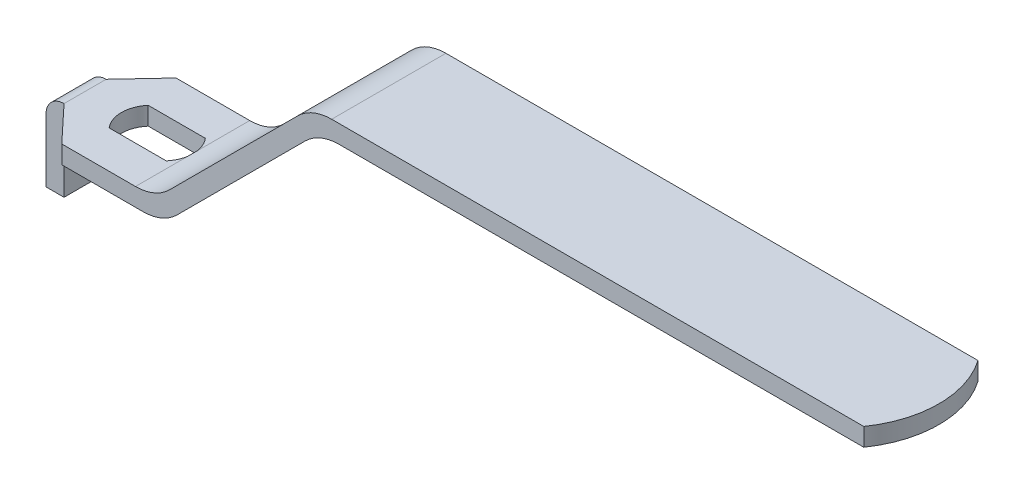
ISO-10303-21;
HEADER;
FILE_DESCRIPTION(('STEP AP214'),'2;1');
FILE_NAME('part.step','',(''),(''),'','','');
FILE_SCHEMA(('AUTOMOTIVE_DESIGN { 1 0 10303 214 1 1 1 1 }'));
ENDSEC;
DATA;
#1=APPLICATION_CONTEXT('core data for automotive mechanical design processes');
#2=APPLICATION_PROTOCOL_DEFINITION('international standard','automotive_design',2000,#1);
#3=PRODUCT_CONTEXT('',#1,'mechanical');
#4=PRODUCT('Part','Part','',(#3));
#5=PRODUCT_RELATED_PRODUCT_CATEGORY('part','',(#4));
#6=PRODUCT_DEFINITION_FORMATION('','',#4);
#7=PRODUCT_DEFINITION_CONTEXT('part definition',#1,'design');
#8=PRODUCT_DEFINITION('design','',#6,#7);
#9=PRODUCT_DEFINITION_SHAPE('','',#8);
#10=(LENGTH_UNIT() NAMED_UNIT(*) SI_UNIT(.MILLI.,.METRE.));
#11=(NAMED_UNIT(*) PLANE_ANGLE_UNIT() SI_UNIT($,.RADIAN.));
#12=(NAMED_UNIT(*) SI_UNIT($,.STERADIAN.) SOLID_ANGLE_UNIT());
#13=UNCERTAINTY_MEASURE_WITH_UNIT(LENGTH_MEASURE(1.E-05),#10,'distance_accuracy_value','');
#14=(GEOMETRIC_REPRESENTATION_CONTEXT(3) GLOBAL_UNCERTAINTY_ASSIGNED_CONTEXT((#13)) GLOBAL_UNIT_ASSIGNED_CONTEXT((#10,
#11,#12)) REPRESENTATION_CONTEXT('',''));
#15=CARTESIAN_POINT('',(0.,0.,0.));
#16=DIRECTION('',(0.,0.,1.));
#17=DIRECTION('',(1.,0.,0.));
#18=AXIS2_PLACEMENT_3D('',#15,#16,#17);
#19=CARTESIAN_POINT('',(-15.,-13.5,9.5));
#20=DIRECTION('',(0.,1.,0.));
#21=DIRECTION('',(0.,0.,1.));
#22=AXIS2_PLACEMENT_3D('',#19,#20,#21);
#23=PLANE('',#22);
#24=DIRECTION('',(1.,0.,0.));
#25=VECTOR('',#24,1.);
#26=CARTESIAN_POINT('',(-23.299911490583,-13.5,-3.5));
#27=LINE('',#26,#25);
#28=CARTESIAN_POINT('',(-15.,-13.5,-3.5));
#29=VERTEX_POINT('',#28);
#30=CARTESIAN_POINT('',(-12.,-13.5,-3.5));
#31=VERTEX_POINT('',#30);
#32=EDGE_CURVE('E219',#29,#31,#27,.T.);
#33=ORIENTED_EDGE('',*,*,#32,.T.);
#34=DIRECTION('',(0.,0.,1.));
#35=VECTOR('',#34,1.);
#36=CARTESIAN_POINT('',(-12.,-13.5,9.5));
#37=LINE('',#36,#35);
#38=CARTESIAN_POINT('',(-12.,-13.5,3.5));
#39=VERTEX_POINT('',#38);
#40=EDGE_CURVE('E220',#31,#39,#37,.T.);
#41=ORIENTED_EDGE('',*,*,#40,.T.);
#42=DIRECTION('',(-1.,0.,0.));
#43=VECTOR('',#42,1.);
#44=CARTESIAN_POINT('',(-23.299911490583,-13.5,3.5));
#45=LINE('',#44,#43);
#46=CARTESIAN_POINT('',(-15.,-13.5,3.5));
#47=VERTEX_POINT('',#46);
#48=EDGE_CURVE('E206',#39,#47,#45,.T.);
#49=ORIENTED_EDGE('',*,*,#48,.T.);
#50=DIRECTION('',(0.,0.,-1.));
#51=VECTOR('',#50,1.);
#52=CARTESIAN_POINT('',(-15.,-13.5,9.5));
#53=LINE('',#52,#51);
#54=EDGE_CURVE('E226',#47,#29,#53,.T.);
#55=ORIENTED_EDGE('',*,*,#54,.T.);
#56=EDGE_LOOP('',(#33,#41,#49,#55));
#57=FACE_BOUND('',#56,.T.);
#58=ADVANCED_FACE('F18',(#57),#23,.F.);
#59=CARTESIAN_POINT('',(-15.,-13.5,9.5));
#60=DIRECTION('',(1.,0.,0.));
#61=DIRECTION('',(0.,0.,-1.));
#62=AXIS2_PLACEMENT_3D('',#59,#60,#61);
#63=PLANE('',#62);
#64=DIRECTION('',(0.,-1.,0.));
#65=VECTOR('',#64,1.);
#66=CARTESIAN_POINT('',(-15.,-19.,-3.5));
#67=LINE('',#66,#65);
#68=CARTESIAN_POINT('',(-15.,-3.,-3.5));
#69=VERTEX_POINT('',#68);
#70=EDGE_CURVE('E173',#69,#29,#67,.T.);
#71=ORIENTED_EDGE('',*,*,#70,.T.);
#72=ORIENTED_EDGE('',*,*,#54,.F.);
#73=DIRECTION('',(0.,1.,0.));
#74=VECTOR('',#73,1.);
#75=CARTESIAN_POINT('',(-15.,-19.,3.5));
#76=LINE('',#75,#74);
#77=CARTESIAN_POINT('',(-15.,-3.,3.5));
#78=VERTEX_POINT('',#77);
#79=EDGE_CURVE('E202',#47,#78,#76,.T.);
#80=ORIENTED_EDGE('',*,*,#79,.T.);
#81=DIRECTION('',(0.,0.,1.));
#82=VECTOR('',#81,1.);
#83=CARTESIAN_POINT('',(-15.,-3.,9.5));
#84=LINE('',#83,#82);
#85=EDGE_CURVE('E177',#69,#78,#84,.T.);
#86=ORIENTED_EDGE('',*,*,#85,.F.);
#87=EDGE_LOOP('',(#71,#72,#80,#86));
#88=FACE_BOUND('',#87,.T.);
#89=ADVANCED_FACE('F447',(#88),#63,.F.);
#90=CARTESIAN_POINT('',(-12.,-13.5,9.5));
#91=DIRECTION('',(-1.,0.,0.));
#92=DIRECTION('',(0.,0.,1.));
#93=AXIS2_PLACEMENT_3D('',#90,#91,#92);
#94=PLANE('',#93);
#95=DIRECTION('',(0.,-1.,0.));
#96=VECTOR('',#95,1.);
#97=CARTESIAN_POINT('',(-12.,-19.,-3.5));
#98=LINE('',#97,#96);
#99=CARTESIAN_POINT('',(-12.,-6.,-3.5));
#100=VERTEX_POINT('',#99);
#101=EDGE_CURVE('E178',#31,#100,#98,.F.);
#102=ORIENTED_EDGE('',*,*,#101,.T.);
#103=DIRECTION('',(0.,0.,1.));
#104=VECTOR('',#103,1.);
#105=CARTESIAN_POINT('',(-12.,-6.,9.5));
#106=LINE('',#105,#104);
#107=CARTESIAN_POINT('',(-12.,-6.,3.50000000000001));
#108=VERTEX_POINT('',#107);
#109=EDGE_CURVE('E205',#100,#108,#106,.T.);
#110=ORIENTED_EDGE('',*,*,#109,.T.);
#111=DIRECTION('',(0.,1.,0.));
#112=VECTOR('',#111,1.);
#113=CARTESIAN_POINT('',(-12.,-19.,3.5));
#114=LINE('',#113,#112);
#115=EDGE_CURVE('E209',#108,#39,#114,.F.);
#116=ORIENTED_EDGE('',*,*,#115,.T.);
#117=ORIENTED_EDGE('',*,*,#40,.F.);
#118=EDGE_LOOP('',(#102,#110,#116,#117));
#119=FACE_BOUND('',#118,.T.);
#120=ADVANCED_FACE('F323',(#119),#94,.F.);
#121=CARTESIAN_POINT('',(-23.299911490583,-19.,-3.5));
#122=DIRECTION('',(0.,0.,1.));
#123=DIRECTION('',(0.,-1.,0.));
#124=AXIS2_PLACEMENT_3D('',#121,#122,#123);
#125=PLANE('',#124);
#126=ORIENTED_EDGE('',*,*,#101,.F.);
#127=ORIENTED_EDGE('',*,*,#32,.F.);
#128=ORIENTED_EDGE('',*,*,#70,.F.);
#129=CARTESIAN_POINT('',(-12.,-3.,-3.5));
#130=DIRECTION('',(0.,0.,1.));
#131=DIRECTION('',(1.,0.,0.));
#132=AXIS2_PLACEMENT_3D('',#129,#130,#131);
#133=CIRCLE('',#132,3.);
#134=CARTESIAN_POINT('',(-12.,0.,-3.5));
#135=VERTEX_POINT('',#134);
#136=EDGE_CURVE('E21',#135,#69,#133,.T.);
#137=ORIENTED_EDGE('',*,*,#136,.F.);
#138=DIRECTION('',(0.,1.,0.));
#139=VECTOR('',#138,1.);
#140=CARTESIAN_POINT('',(-12.,-19.,-3.5));
#141=LINE('',#140,#139);
#142=EDGE_CURVE('E154',#135,#100,#141,.F.);
#143=ORIENTED_EDGE('',*,*,#142,.T.);
#144=EDGE_LOOP('',(#126,#127,#128,#137,#143));
#145=FACE_BOUND('',#144,.T.);
#146=ADVANCED_FACE('F170',(#145),#125,.F.);
#147=CARTESIAN_POINT('',(0.95032896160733,0.,0.));
#148=DIRECTION('',(0.,-1.,0.));
#149=DIRECTION('',(1.,0.,0.));
#150=AXIS2_PLACEMENT_3D('',#147,#148,#149);
#151=PLANE('',#150);
#152=CARTESIAN_POINT('',(0.95032896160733,0.,0.));
#153=DIRECTION('',(0.,-1.,0.));
#154=DIRECTION('',(1.,0.,0.));
#155=AXIS2_PLACEMENT_3D('',#152,#153,#154);
#156=CIRCLE('',#155,5.);
#157=CARTESIAN_POINT('',(5.88244392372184,0.,-0.821122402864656));
#158=VERTEX_POINT('',#157);
#159=CARTESIAN_POINT('',(5.88244392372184,0.,0.821122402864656));
#160=VERTEX_POINT('',#159);
#161=EDGE_CURVE('E305',#158,#160,#156,.T.);
#162=ORIENTED_EDGE('',*,*,#161,.T.);
#163=DIRECTION('',(0.,0.,1.));
#164=VECTOR('',#163,1.);
#165=CARTESIAN_POINT('',(5.88244392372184,0.,9.5));
#166=LINE('',#165,#164);
#167=EDGE_CURVE('E214',#160,#158,#166,.F.);
#168=ORIENTED_EDGE('',*,*,#167,.T.);
#169=EDGE_LOOP('',(#162,#168));
#170=FACE_BOUND('',#169,.T.);
#171=ADVANCED_FACE('F521',(#170),#151,.T.);
#172=CARTESIAN_POINT('',(-12.,-3.,9.5));
#173=DIRECTION('',(0.,0.,1.));
#174=DIRECTION('',(1.,0.,0.));
#175=AXIS2_PLACEMENT_3D('',#172,#173,#174);
#176=CYLINDRICAL_SURFACE('',#175,3.);
#177=ORIENTED_EDGE('',*,*,#85,.T.);
#178=CARTESIAN_POINT('',(-12.,-3.,3.5));
#179=DIRECTION('',(0.,0.,1.));
#180=DIRECTION('',(1.,0.,0.));
#181=AXIS2_PLACEMENT_3D('',#178,#179,#180);
#182=CIRCLE('',#181,3.);
#183=CARTESIAN_POINT('',(-12.,0.,3.50000000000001));
#184=VERTEX_POINT('',#183);
#185=EDGE_CURVE('E191',#78,#184,#182,.F.);
#186=ORIENTED_EDGE('',*,*,#185,.T.);
#187=DIRECTION('',(0.,0.,1.));
#188=VECTOR('',#187,1.);
#189=CARTESIAN_POINT('',(-12.,0.,9.5));
#190=LINE('',#189,#188);
#191=EDGE_CURVE('E183',#184,#135,#190,.F.);
#192=ORIENTED_EDGE('',*,*,#191,.T.);
#193=ORIENTED_EDGE('',*,*,#136,.T.);
#194=EDGE_LOOP('',(#177,#186,#192,#193));
#195=FACE_BOUND('',#194,.T.);
#196=ADVANCED_FACE('F189',(#195),#176,.T.);
#197=CARTESIAN_POINT('',(-23.299911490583,-19.,3.5));
#198=DIRECTION('',(0.,0.,-1.));
#199=DIRECTION('',(-1.,0.,0.));
#200=AXIS2_PLACEMENT_3D('',#197,#198,#199);
#201=PLANE('',#200);
#202=ORIENTED_EDGE('',*,*,#48,.F.);
#203=ORIENTED_EDGE('',*,*,#115,.F.);
#204=DIRECTION('',(0.,1.,0.));
#205=VECTOR('',#204,1.);
#206=CARTESIAN_POINT('',(-12.,-19.,3.50000000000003));
#207=LINE('',#206,#205);
#208=EDGE_CURVE('E292',#108,#184,#207,.T.);
#209=ORIENTED_EDGE('',*,*,#208,.T.);
#210=ORIENTED_EDGE('',*,*,#185,.F.);
#211=ORIENTED_EDGE('',*,*,#79,.F.);
#212=EDGE_LOOP('',(#202,#203,#209,#210,#211));
#213=FACE_BOUND('',#212,.T.);
#214=ADVANCED_FACE('F450',(#213),#201,.F.);
#215=CARTESIAN_POINT('',(-9.,-6.,9.5));
#216=DIRECTION('',(0.,0.,1.));
#217=DIRECTION('',(1.,0.,0.));
#218=AXIS2_PLACEMENT_3D('',#215,#216,#217);
#219=CYLINDRICAL_SURFACE('',#218,3.);
#220=CARTESIAN_POINT('',(-9.,-6.,-6.70000000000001));
#221=DIRECTION('',(0.729537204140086,0.,0.683941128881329));
#222=DIRECTION('',(-0.683941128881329,0.,0.729537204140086));
#223=AXIS2_PLACEMENT_3D('',#220,#221,#222);
#224=ELLIPSE('',#223,4.38634243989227,3.);
#225=CARTESIAN_POINT('',(-9.,-3.,-6.70000000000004));
#226=VERTEX_POINT('',#225);
#227=EDGE_CURVE('E162',#100,#226,#224,.F.);
#228=ORIENTED_EDGE('',*,*,#227,.T.);
#229=DIRECTION('',(0.,0.,1.));
#230=VECTOR('',#229,1.);
#231=CARTESIAN_POINT('',(-9.,-3.,9.5));
#232=LINE('',#231,#230);
#233=CARTESIAN_POINT('',(-9.,-3.,6.7));
#234=VERTEX_POINT('',#233);
#235=EDGE_CURVE('E200',#226,#234,#232,.T.);
#236=ORIENTED_EDGE('',*,*,#235,.T.);
#237=CARTESIAN_POINT('',(-9.,-6.,6.7));
#238=DIRECTION('',(0.729537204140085,0.,-0.68394112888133));
#239=DIRECTION('',(0.68394112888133,0.,0.729537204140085));
#240=AXIS2_PLACEMENT_3D('',#237,#238,#239);
#241=ELLIPSE('',#240,4.38634243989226,3.);
#242=EDGE_CURVE('E187',#234,#108,#241,.F.);
#243=ORIENTED_EDGE('',*,*,#242,.T.);
#244=ORIENTED_EDGE('',*,*,#109,.F.);
#245=EDGE_LOOP('',(#228,#236,#243,#244));
#246=FACE_BOUND('',#245,.T.);
#247=ADVANCED_FACE('F336',(#246),#219,.F.);
#248=CARTESIAN_POINT('',(-0.950328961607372,-13.501,0.));
#249=DIRECTION('',(0.,-1.,0.));
#250=DIRECTION('',(1.,0.,0.));
#251=AXIS2_PLACEMENT_3D('',#248,#249,#250);
#252=CYLINDRICAL_SURFACE('',#251,5.);
#253=DIRECTION('',(0.,1.,0.));
#254=VECTOR('',#253,1.);
#255=CARTESIAN_POINT('',(-4.75,-13.501,-3.25));
#256=LINE('',#255,#254);
#257=CARTESIAN_POINT('',(-4.75,-3.00000000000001,-3.25));
#258=VERTEX_POINT('',#257);
#259=CARTESIAN_POINT('',(-4.75,0.,-3.25));
#260=VERTEX_POINT('',#259);
#261=EDGE_CURVE('E312',#258,#260,#256,.T.);
#262=ORIENTED_EDGE('',*,*,#261,.T.);
#263=CARTESIAN_POINT('',(-0.95032896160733,0.,0.));
#264=DIRECTION('',(0.,-1.,0.));
#265=DIRECTION('',(1.,0.,0.));
#266=AXIS2_PLACEMENT_3D('',#263,#264,#265);
#267=CIRCLE('',#266,5.);
#268=CARTESIAN_POINT('',(-4.75,0.,3.25));
#269=VERTEX_POINT('',#268);
#270=EDGE_CURVE('E296',#260,#269,#267,.F.);
#271=ORIENTED_EDGE('',*,*,#270,.T.);
#272=DIRECTION('',(0.,1.,0.));
#273=VECTOR('',#272,1.);
#274=CARTESIAN_POINT('',(-4.75,-13.501,3.25));
#275=LINE('',#274,#273);
#276=CARTESIAN_POINT('',(-4.75,-3.00000000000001,3.25));
#277=VERTEX_POINT('',#276);
#278=EDGE_CURVE('E304',#269,#277,#275,.F.);
#279=ORIENTED_EDGE('',*,*,#278,.T.);
#280=CARTESIAN_POINT('',(-0.950328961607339,-3.00000000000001,0.));
#281=DIRECTION('',(0.,-1.,0.));
#282=DIRECTION('',(1.,0.,0.));
#283=AXIS2_PLACEMENT_3D('',#280,#281,#282);
#284=CIRCLE('',#283,5.);
#285=EDGE_CURVE('E287',#277,#258,#284,.T.);
#286=ORIENTED_EDGE('',*,*,#285,.T.);
#287=EDGE_LOOP('',(#262,#271,#279,#286));
#288=FACE_BOUND('',#287,.T.);
#289=ADVANCED_FACE('F511',(#288),#252,.F.);
#290=CARTESIAN_POINT('',(-4.75,-13.501,-3.25));
#291=DIRECTION('',(0.,0.,-1.));
#292=DIRECTION('',(-1.,0.,0.));
#293=AXIS2_PLACEMENT_3D('',#290,#291,#292);
#294=PLANE('',#293);
#295=DIRECTION('',(0.,-1.,0.));
#296=VECTOR('',#295,1.);
#297=CARTESIAN_POINT('',(4.74999999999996,-13.501,-3.25));
#298=LINE('',#297,#296);
#299=CARTESIAN_POINT('',(4.74999999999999,-2.99999999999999,-3.25));
#300=VERTEX_POINT('',#299);
#301=CARTESIAN_POINT('',(4.75,0.,-3.25));
#302=VERTEX_POINT('',#301);
#303=EDGE_CURVE('E308',#300,#302,#298,.F.);
#304=ORIENTED_EDGE('',*,*,#303,.T.);
#305=DIRECTION('',(1.,0.,0.));
#306=VECTOR('',#305,1.);
#307=CARTESIAN_POINT('',(-12.,0.,-3.25));
#308=LINE('',#307,#306);
#309=EDGE_CURVE('E299',#302,#260,#308,.F.);
#310=ORIENTED_EDGE('',*,*,#309,.T.);
#311=ORIENTED_EDGE('',*,*,#261,.F.);
#312=DIRECTION('',(1.,0.,0.));
#313=VECTOR('',#312,1.);
#314=CARTESIAN_POINT('',(-9.,-3.,-3.25));
#315=LINE('',#314,#313);
#316=EDGE_CURVE('E286',#258,#300,#315,.T.);
#317=ORIENTED_EDGE('',*,*,#316,.T.);
#318=EDGE_LOOP('',(#304,#310,#311,#317));
#319=FACE_BOUND('',#318,.T.);
#320=ADVANCED_FACE('F507',(#319),#294,.F.);
#321=CARTESIAN_POINT('',(0.950328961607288,-13.501,0.));
#322=DIRECTION('',(0.,-1.,0.));
#323=DIRECTION('',(1.,0.,0.));
#324=AXIS2_PLACEMENT_3D('',#321,#322,#323);
#325=CYLINDRICAL_SURFACE('',#324,5.);
#326=DIRECTION('',(0.,1.,0.));
#327=VECTOR('',#326,1.);
#328=CARTESIAN_POINT('',(4.75,-13.501,3.25));
#329=LINE('',#328,#327);
#330=CARTESIAN_POINT('',(4.74999999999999,-2.99999999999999,3.25));
#331=VERTEX_POINT('',#330);
#332=CARTESIAN_POINT('',(4.75,0.,3.25));
#333=VERTEX_POINT('',#332);
#334=EDGE_CURVE('E307',#331,#333,#329,.T.);
#335=ORIENTED_EDGE('',*,*,#334,.T.);
#336=CARTESIAN_POINT('',(0.95032896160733,0.,0.));
#337=DIRECTION('',(0.,-1.,0.));
#338=DIRECTION('',(1.,0.,0.));
#339=AXIS2_PLACEMENT_3D('',#336,#337,#338);
#340=CIRCLE('',#339,5.);
#341=EDGE_CURVE('E196',#333,#160,#340,.F.);
#342=ORIENTED_EDGE('',*,*,#341,.T.);
#343=ORIENTED_EDGE('',*,*,#161,.F.);
#344=CARTESIAN_POINT('',(0.95032896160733,0.,0.));
#345=DIRECTION('',(0.,-1.,0.));
#346=DIRECTION('',(1.,0.,0.));
#347=AXIS2_PLACEMENT_3D('',#344,#345,#346);
#348=CIRCLE('',#347,5.);
#349=EDGE_CURVE('E300',#158,#302,#348,.F.);
#350=ORIENTED_EDGE('',*,*,#349,.T.);
#351=ORIENTED_EDGE('',*,*,#303,.F.);
#352=CARTESIAN_POINT('',(0.950328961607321,-2.99999999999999,0.));
#353=DIRECTION('',(0.,-1.,0.));
#354=DIRECTION('',(1.,0.,0.));
#355=AXIS2_PLACEMENT_3D('',#352,#353,#354);
#356=CIRCLE('',#355,5.);
#357=EDGE_CURVE('E282',#300,#331,#356,.T.);
#358=ORIENTED_EDGE('',*,*,#357,.T.);
#359=EDGE_LOOP('',(#335,#342,#343,#350,#351,#358));
#360=FACE_BOUND('',#359,.T.);
#361=ADVANCED_FACE('F503',(#360),#325,.F.);
#362=CARTESIAN_POINT('',(-4.75,-13.501,3.25));
#363=DIRECTION('',(0.,0.,1.));
#364=DIRECTION('',(1.,0.,0.));
#365=AXIS2_PLACEMENT_3D('',#362,#363,#364);
#366=PLANE('',#365);
#367=ORIENTED_EDGE('',*,*,#278,.F.);
#368=DIRECTION('',(1.,0.,0.));
#369=VECTOR('',#368,1.);
#370=CARTESIAN_POINT('',(-12.,0.,3.25));
#371=LINE('',#370,#369);
#372=EDGE_CURVE('E295',#269,#333,#371,.T.);
#373=ORIENTED_EDGE('',*,*,#372,.T.);
#374=ORIENTED_EDGE('',*,*,#334,.F.);
#375=DIRECTION('',(1.,0.,0.));
#376=VECTOR('',#375,1.);
#377=CARTESIAN_POINT('',(-9.,-3.,3.25));
#378=LINE('',#377,#376);
#379=EDGE_CURVE('E285',#331,#277,#378,.F.);
#380=ORIENTED_EDGE('',*,*,#379,.T.);
#381=EDGE_LOOP('',(#367,#373,#374,#380));
#382=FACE_BOUND('',#381,.T.);
#383=ADVANCED_FACE('F500',(#382),#366,.F.);
#384=CARTESIAN_POINT('',(-12.,-19.,-3.5));
#385=DIRECTION('',(0.729537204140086,0.,0.683941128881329));
#386=DIRECTION('',(0.683941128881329,0.,-0.729537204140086));
#387=AXIS2_PLACEMENT_3D('',#384,#385,#386);
#388=PLANE('',#387);
#389=DIRECTION('',(0.683941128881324,0.,-0.729537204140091));
#390=VECTOR('',#389,1.);
#391=CARTESIAN_POINT('',(-12.,0.,-3.5));
#392=LINE('',#391,#390);
#393=CARTESIAN_POINT('',(-6.37500000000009,0.,-9.5));
#394=VERTEX_POINT('',#393);
#395=EDGE_CURVE('E159',#135,#394,#392,.T.);
#396=ORIENTED_EDGE('',*,*,#395,.T.);
#397=DIRECTION('',(0.,1.,0.));
#398=VECTOR('',#397,1.);
#399=CARTESIAN_POINT('',(-6.37500000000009,-3.,-9.5));
#400=LINE('',#399,#398);
#401=CARTESIAN_POINT('',(-6.37500000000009,-3.,-9.5));
#402=VERTEX_POINT('',#401);
#403=EDGE_CURVE('E349',#394,#402,#400,.F.);
#404=ORIENTED_EDGE('',*,*,#403,.T.);
#405=DIRECTION('',(-0.683941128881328,0.,0.729537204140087));
#406=VECTOR('',#405,1.);
#407=CARTESIAN_POINT('',(-6.37500000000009,-3.,-9.5));
#408=LINE('',#407,#406);
#409=EDGE_CURVE('E340',#402,#226,#408,.T.);
#410=ORIENTED_EDGE('',*,*,#409,.T.);
#411=ORIENTED_EDGE('',*,*,#227,.F.);
#412=ORIENTED_EDGE('',*,*,#142,.F.);
#413=EDGE_LOOP('',(#396,#404,#410,#411,#412));
#414=FACE_BOUND('',#413,.T.);
#415=ADVANCED_FACE('F156',(#414),#388,.F.);
#416=CARTESIAN_POINT('',(11.5392981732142,2.34314575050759,9.5));
#417=DIRECTION('',(0.707106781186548,-0.707106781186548,0.));
#418=DIRECTION('',(0.707106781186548,0.707106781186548,0.));
#419=AXIS2_PLACEMENT_3D('',#416,#417,#418);
#420=PLANE('',#419);
#421=DIRECTION('',(0.,0.,1.));
#422=VECTOR('',#421,1.);
#423=CARTESIAN_POINT('',(11.5392981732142,2.34314575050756,9.5));
#424=LINE('',#423,#422);
#425=CARTESIAN_POINT('',(11.5392981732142,2.3431457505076,-9.5));
#426=VERTEX_POINT('',#425);
#427=CARTESIAN_POINT('',(11.5392981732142,2.3431457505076,9.5));
#428=VERTEX_POINT('',#427);
#429=EDGE_CURVE('E166',#426,#428,#424,.T.);
#430=ORIENTED_EDGE('',*,*,#429,.T.);
#431=DIRECTION('',(-0.707106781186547,-0.707106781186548,0.));
#432=VECTOR('',#431,1.);
#433=CARTESIAN_POINT('',(32.8530066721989,23.6568542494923,9.5));
#434=LINE('',#433,#432);
#435=CARTESIAN_POINT('',(32.8530066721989,23.6568542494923,9.5));
#436=VERTEX_POINT('',#435);
#437=EDGE_CURVE('E257',#436,#428,#434,.T.);
#438=ORIENTED_EDGE('',*,*,#437,.F.);
#439=DIRECTION('',(0.,0.,1.));
#440=VECTOR('',#439,1.);
#441=CARTESIAN_POINT('',(32.8530066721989,23.6568542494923,9.5));
#442=LINE('',#441,#440);
#443=CARTESIAN_POINT('',(32.8530066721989,23.6568542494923,-9.5));
#444=VERTEX_POINT('',#443);
#445=EDGE_CURVE('E281',#444,#436,#442,.T.);
#446=ORIENTED_EDGE('',*,*,#445,.F.);
#447=DIRECTION('',(-0.707106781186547,-0.707106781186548,0.));
#448=VECTOR('',#447,1.);
#449=CARTESIAN_POINT('',(32.8530066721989,23.6568542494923,-9.5));
#450=LINE('',#449,#448);
#451=EDGE_CURVE('E277',#444,#426,#450,.T.);
#452=ORIENTED_EDGE('',*,*,#451,.T.);
#453=EDGE_LOOP('',(#430,#438,#446,#452));
#454=FACE_BOUND('',#453,.T.);
#455=ADVANCED_FACE('F396',(#454),#420,.F.);
#456=CARTESIAN_POINT('',(5.88244392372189,8.,9.5));
#457=DIRECTION('',(0.,0.,1.));
#458=DIRECTION('',(1.,0.,0.));
#459=AXIS2_PLACEMENT_3D('',#456,#457,#458);
#460=CYLINDRICAL_SURFACE('',#459,8.);
#461=DIRECTION('',(0.,0.,1.));
#462=VECTOR('',#461,1.);
#463=CARTESIAN_POINT('',(5.88244392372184,0.,9.5));
#464=LINE('',#463,#462);
#465=CARTESIAN_POINT('',(5.88244392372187,0.,-9.5));
#466=VERTEX_POINT('',#465);
#467=EDGE_CURVE('E217',#466,#158,#464,.T.);
#468=ORIENTED_EDGE('',*,*,#467,.T.);
#469=ORIENTED_EDGE('',*,*,#167,.F.);
#470=DIRECTION('',(0.,0.,1.));
#471=VECTOR('',#470,1.);
#472=CARTESIAN_POINT('',(5.88244392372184,0.,9.5));
#473=LINE('',#472,#471);
#474=CARTESIAN_POINT('',(5.88244392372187,0.,9.5));
#475=VERTEX_POINT('',#474);
#476=EDGE_CURVE('E193',#160,#475,#473,.T.);
#477=ORIENTED_EDGE('',*,*,#476,.T.);
#478=CARTESIAN_POINT('',(5.88244392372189,8.,9.5));
#479=DIRECTION('',(0.,0.,1.));
#480=DIRECTION('',(1.,0.,0.));
#481=AXIS2_PLACEMENT_3D('',#478,#479,#480);
#482=CIRCLE('',#481,8.);
#483=EDGE_CURVE('E254',#428,#475,#482,.F.);
#484=ORIENTED_EDGE('',*,*,#483,.F.);
#485=ORIENTED_EDGE('',*,*,#429,.F.);
#486=CARTESIAN_POINT('',(5.88244392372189,8.,-9.5));
#487=DIRECTION('',(0.,0.,1.));
#488=DIRECTION('',(1.,0.,0.));
#489=AXIS2_PLACEMENT_3D('',#486,#487,#488);
#490=CIRCLE('',#489,8.);
#491=EDGE_CURVE('E274',#426,#466,#490,.F.);
#492=ORIENTED_EDGE('',*,*,#491,.T.);
#493=EDGE_LOOP('',(#468,#469,#477,#484,#485,#492));
#494=FACE_BOUND('',#493,.T.);
#495=ADVANCED_FACE('F400',(#494),#460,.F.);
#496=CARTESIAN_POINT('',(-12.,0.,9.5));
#497=DIRECTION('',(0.,-1.,0.));
#498=DIRECTION('',(1.,0.,0.));
#499=AXIS2_PLACEMENT_3D('',#496,#497,#498);
#500=PLANE('',#499);
#501=ORIENTED_EDGE('',*,*,#395,.F.);
#502=ORIENTED_EDGE('',*,*,#191,.F.);
#503=DIRECTION('',(-0.68394112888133,0.,-0.729537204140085));
#504=VECTOR('',#503,1.);
#505=CARTESIAN_POINT('',(-12.,0.,3.5));
#506=LINE('',#505,#504);
#507=CARTESIAN_POINT('',(-6.375,0.,9.5));
#508=VERTEX_POINT('',#507);
#509=EDGE_CURVE('E332',#184,#508,#506,.F.);
#510=ORIENTED_EDGE('',*,*,#509,.T.);
#511=DIRECTION('',(1.,0.,0.));
#512=VECTOR('',#511,1.);
#513=CARTESIAN_POINT('',(-12.,0.,9.5));
#514=LINE('',#513,#512);
#515=EDGE_CURVE('E256',#475,#508,#514,.F.);
#516=ORIENTED_EDGE('',*,*,#515,.F.);
#517=ORIENTED_EDGE('',*,*,#476,.F.);
#518=ORIENTED_EDGE('',*,*,#341,.F.);
#519=ORIENTED_EDGE('',*,*,#372,.F.);
#520=ORIENTED_EDGE('',*,*,#270,.F.);
#521=ORIENTED_EDGE('',*,*,#309,.F.);
#522=ORIENTED_EDGE('',*,*,#349,.F.);
#523=ORIENTED_EDGE('',*,*,#467,.F.);
#524=DIRECTION('',(1.,0.,0.));
#525=VECTOR('',#524,1.);
#526=CARTESIAN_POINT('',(-12.,0.,-9.5));
#527=LINE('',#526,#525);
#528=EDGE_CURVE('E186',#466,#394,#527,.F.);
#529=ORIENTED_EDGE('',*,*,#528,.T.);
#530=EDGE_LOOP('',(#501,#502,#510,#516,#517,#518,#519,#520,#521,#522,#523,#529));
#531=FACE_BOUND('',#530,.T.);
#532=ADVANCED_FACE('F181',(#531),#500,.F.);
#533=CARTESIAN_POINT('',(-12.,-19.,3.5));
#534=DIRECTION('',(0.729537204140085,0.,-0.68394112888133));
#535=DIRECTION('',(-0.68394112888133,0.,-0.729537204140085));
#536=AXIS2_PLACEMENT_3D('',#533,#534,#535);
#537=PLANE('',#536);
#538=DIRECTION('',(0.,1.,0.));
#539=VECTOR('',#538,1.);
#540=CARTESIAN_POINT('',(-6.375,-3.,9.5));
#541=LINE('',#540,#539);
#542=CARTESIAN_POINT('',(-6.37500000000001,-3.,9.50000000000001));
#543=VERTEX_POINT('',#542);
#544=EDGE_CURVE('E380',#508,#543,#541,.F.);
#545=ORIENTED_EDGE('',*,*,#544,.F.);
#546=ORIENTED_EDGE('',*,*,#509,.F.);
#547=ORIENTED_EDGE('',*,*,#208,.F.);
#548=ORIENTED_EDGE('',*,*,#242,.F.);
#549=DIRECTION('',(0.68394112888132,0.,0.729537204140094));
#550=VECTOR('',#549,1.);
#551=CARTESIAN_POINT('',(-9.,-3.,6.7));
#552=LINE('',#551,#550);
#553=EDGE_CURVE('E341',#234,#543,#552,.T.);
#554=ORIENTED_EDGE('',*,*,#553,.T.);
#555=EDGE_LOOP('',(#545,#546,#547,#548,#554));
#556=FACE_BOUND('',#555,.T.);
#557=ADVANCED_FACE('F329',(#556),#537,.F.);
#558=CARTESIAN_POINT('',(-9.,-3.,9.5));
#559=DIRECTION('',(0.,1.,0.));
#560=DIRECTION('',(0.,0.,1.));
#561=AXIS2_PLACEMENT_3D('',#558,#559,#560);
#562=PLANE('',#561);
#563=ORIENTED_EDGE('',*,*,#357,.F.);
#564=ORIENTED_EDGE('',*,*,#316,.F.);
#565=ORIENTED_EDGE('',*,*,#285,.F.);
#566=ORIENTED_EDGE('',*,*,#379,.F.);
#567=EDGE_LOOP('',(#563,#564,#565,#566));
#568=FACE_BOUND('',#567,.T.);
#569=ORIENTED_EDGE('',*,*,#409,.F.);
#570=DIRECTION('',(1.,0.,0.));
#571=VECTOR('',#570,1.);
#572=CARTESIAN_POINT('',(-12.,-3.,-9.5));
#573=LINE('',#572,#571);
#574=CARTESIAN_POINT('',(7.1250846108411,-3.,-9.5));
#575=VERTEX_POINT('',#574);
#576=EDGE_CURVE('E273',#402,#575,#573,.T.);
#577=ORIENTED_EDGE('',*,*,#576,.T.);
#578=DIRECTION('',(0.,0.,1.));
#579=VECTOR('',#578,1.);
#580=CARTESIAN_POINT('',(7.1250846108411,-3.,9.5));
#581=LINE('',#580,#579);
#582=CARTESIAN_POINT('',(7.1250846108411,-3.,9.5));
#583=VERTEX_POINT('',#582);
#584=EDGE_CURVE('E373',#583,#575,#581,.F.);
#585=ORIENTED_EDGE('',*,*,#584,.F.);
#586=DIRECTION('',(1.,0.,0.));
#587=VECTOR('',#586,1.);
#588=CARTESIAN_POINT('',(-12.,-3.,9.5));
#589=LINE('',#588,#587);
#590=EDGE_CURVE('E253',#543,#583,#589,.T.);
#591=ORIENTED_EDGE('',*,*,#590,.F.);
#592=ORIENTED_EDGE('',*,*,#553,.F.);
#593=ORIENTED_EDGE('',*,*,#235,.F.);
#594=EDGE_LOOP('',(#569,#577,#585,#591,#592,#593));
#595=FACE_BOUND('',#594,.T.);
#596=ADVANCED_FACE('F434',(#568,#595),#562,.F.);
#597=CARTESIAN_POINT('',(7.1250846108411,5.,9.5));
#598=DIRECTION('',(0.,0.,1.));
#599=DIRECTION('',(1.,0.,0.));
#600=AXIS2_PLACEMENT_3D('',#597,#598,#599);
#601=CYLINDRICAL_SURFACE('',#600,8.);
#602=CARTESIAN_POINT('',(7.1250846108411,5.,9.5));
#603=DIRECTION('',(0.,0.,1.));
#604=DIRECTION('',(1.,0.,0.));
#605=AXIS2_PLACEMENT_3D('',#602,#603,#604);
#606=CIRCLE('',#605,8.);
#607=CARTESIAN_POINT('',(12.7819388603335,-0.656854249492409,9.5));
#608=VERTEX_POINT('',#607);
#609=EDGE_CURVE('E251',#583,#608,#606,.T.);
#610=ORIENTED_EDGE('',*,*,#609,.F.);
#611=ORIENTED_EDGE('',*,*,#584,.T.);
#612=CARTESIAN_POINT('',(7.1250846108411,5.,-9.5));
#613=DIRECTION('',(0.,0.,1.));
#614=DIRECTION('',(1.,0.,0.));
#615=AXIS2_PLACEMENT_3D('',#612,#613,#614);
#616=CIRCLE('',#615,8.);
#617=CARTESIAN_POINT('',(12.7819388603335,-0.656854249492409,-9.5));
#618=VERTEX_POINT('',#617);
#619=EDGE_CURVE('E270',#575,#618,#616,.T.);
#620=ORIENTED_EDGE('',*,*,#619,.T.);
#621=DIRECTION('',(0.,0.,1.));
#622=VECTOR('',#621,1.);
#623=CARTESIAN_POINT('',(12.7819388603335,-0.656854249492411,9.5));
#624=LINE('',#623,#622);
#625=EDGE_CURVE('E370',#618,#608,#624,.T.);
#626=ORIENTED_EDGE('',*,*,#625,.T.);
#627=EDGE_LOOP('',(#610,#611,#620,#626));
#628=FACE_BOUND('',#627,.T.);
#629=ADVANCED_FACE('F431',(#628),#601,.T.);
#630=CARTESIAN_POINT('',(12.7819388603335,-0.656854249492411,9.5));
#631=DIRECTION('',(-0.707106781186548,0.707106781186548,0.));
#632=DIRECTION('',(-0.707106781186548,-0.707106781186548,0.));
#633=AXIS2_PLACEMENT_3D('',#630,#631,#632);
#634=PLANE('',#633);
#635=DIRECTION('',(0.,0.,1.));
#636=VECTOR('',#635,1.);
#637=CARTESIAN_POINT('',(34.0956473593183,20.6568542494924,9.5));
#638=LINE('',#637,#636);
#639=CARTESIAN_POINT('',(34.0956473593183,20.6568542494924,-9.5));
#640=VERTEX_POINT('',#639);
#641=CARTESIAN_POINT('',(34.0956473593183,20.6568542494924,9.5));
#642=VERTEX_POINT('',#641);
#643=EDGE_CURVE('E367',#640,#642,#638,.T.);
#644=ORIENTED_EDGE('',*,*,#643,.T.);
#645=DIRECTION('',(0.707106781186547,0.707106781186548,0.));
#646=VECTOR('',#645,1.);
#647=CARTESIAN_POINT('',(12.7819388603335,-0.656854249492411,9.5));
#648=LINE('',#647,#646);
#649=EDGE_CURVE('E250',#608,#642,#648,.T.);
#650=ORIENTED_EDGE('',*,*,#649,.F.);
#651=ORIENTED_EDGE('',*,*,#625,.F.);
#652=DIRECTION('',(0.707106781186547,0.707106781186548,0.));
#653=VECTOR('',#652,1.);
#654=CARTESIAN_POINT('',(12.7819388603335,-0.656854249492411,-9.5));
#655=LINE('',#654,#653);
#656=EDGE_CURVE('E269',#618,#640,#655,.T.);
#657=ORIENTED_EDGE('',*,*,#656,.T.);
#658=EDGE_LOOP('',(#644,#650,#651,#657));
#659=FACE_BOUND('',#658,.T.);
#660=ADVANCED_FACE('F419',(#659),#634,.F.);
#661=CARTESIAN_POINT('',(39.7525016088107,15.,9.5));
#662=DIRECTION('',(0.,0.,1.));
#663=DIRECTION('',(1.,0.,0.));
#664=AXIS2_PLACEMENT_3D('',#661,#662,#663);
#665=CYLINDRICAL_SURFACE('',#664,8.);
#666=DIRECTION('',(0.,0.,1.));
#667=VECTOR('',#666,1.);
#668=CARTESIAN_POINT('',(39.7525016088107,23.,9.5));
#669=LINE('',#668,#667);
#670=CARTESIAN_POINT('',(39.7525016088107,23.,-9.5));
#671=VERTEX_POINT('',#670);
#672=CARTESIAN_POINT('',(39.7525016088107,23.,9.5));
#673=VERTEX_POINT('',#672);
#674=EDGE_CURVE('E364',#671,#673,#669,.T.);
#675=ORIENTED_EDGE('',*,*,#674,.T.);
#676=CARTESIAN_POINT('',(39.7525016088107,15.,9.5));
#677=DIRECTION('',(0.,0.,1.));
#678=DIRECTION('',(1.,0.,0.));
#679=AXIS2_PLACEMENT_3D('',#676,#677,#678);
#680=CIRCLE('',#679,8.);
#681=EDGE_CURVE('E247',#642,#673,#680,.F.);
#682=ORIENTED_EDGE('',*,*,#681,.F.);
#683=ORIENTED_EDGE('',*,*,#643,.F.);
#684=CARTESIAN_POINT('',(39.7525016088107,15.,-9.5));
#685=DIRECTION('',(0.,0.,1.));
#686=DIRECTION('',(1.,0.,0.));
#687=AXIS2_PLACEMENT_3D('',#684,#685,#686);
#688=CIRCLE('',#687,8.);
#689=EDGE_CURVE('E265',#640,#671,#688,.F.);
#690=ORIENTED_EDGE('',*,*,#689,.T.);
#691=EDGE_LOOP('',(#675,#682,#683,#690));
#692=FACE_BOUND('',#691,.T.);
#693=ADVANCED_FACE('F478',(#692),#665,.F.);
#694=CARTESIAN_POINT('',(39.7525016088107,23.,9.5));
#695=DIRECTION('',(0.,1.,0.));
#696=DIRECTION('',(0.,0.,1.));
#697=AXIS2_PLACEMENT_3D('',#694,#695,#696);
#698=PLANE('',#697);
#699=CARTESIAN_POINT('',(113.458333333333,23.,0.));
#700=DIRECTION('',(0.,-1.,0.));
#701=DIRECTION('',(0.,0.,-1.));
#702=AXIS2_PLACEMENT_3D('',#699,#700,#701);
#703=CIRCLE('',#702,16.5416666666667);
#704=CARTESIAN_POINT('',(127.,23.,9.5));
#705=VERTEX_POINT('',#704);
#706=CARTESIAN_POINT('',(127.,23.,-9.49999999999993));
#707=VERTEX_POINT('',#706);
#708=EDGE_CURVE('E261',#705,#707,#703,.F.);
#709=ORIENTED_EDGE('',*,*,#708,.F.);
#710=DIRECTION('',(1.,0.,0.));
#711=VECTOR('',#710,1.);
#712=CARTESIAN_POINT('',(-12.,23.,9.5));
#713=LINE('',#712,#711);
#714=EDGE_CURVE('E249',#673,#705,#713,.T.);
#715=ORIENTED_EDGE('',*,*,#714,.F.);
#716=ORIENTED_EDGE('',*,*,#674,.F.);
#717=DIRECTION('',(1.,0.,0.));
#718=VECTOR('',#717,1.);
#719=CARTESIAN_POINT('',(-12.,23.,-9.5));
#720=LINE('',#719,#718);
#721=EDGE_CURVE('E268',#671,#707,#720,.T.);
#722=ORIENTED_EDGE('',*,*,#721,.T.);
#723=EDGE_LOOP('',(#709,#715,#716,#722));
#724=FACE_BOUND('',#723,.T.);
#725=ADVANCED_FACE('F474',(#724),#698,.F.);
#726=CARTESIAN_POINT('',(38.5098609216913,18.,9.5));
#727=DIRECTION('',(0.,0.,1.));
#728=DIRECTION('',(1.,0.,0.));
#729=AXIS2_PLACEMENT_3D('',#726,#727,#728);
#730=CYLINDRICAL_SURFACE('',#729,8.);
#731=CARTESIAN_POINT('',(38.5098609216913,18.,9.5));
#732=DIRECTION('',(0.,0.,1.));
#733=DIRECTION('',(1.,0.,0.));
#734=AXIS2_PLACEMENT_3D('',#731,#732,#733);
#735=CIRCLE('',#734,8.);
#736=CARTESIAN_POINT('',(38.5098609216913,26.,9.5));
#737=VERTEX_POINT('',#736);
#738=EDGE_CURVE('E258',#737,#436,#735,.T.);
#739=ORIENTED_EDGE('',*,*,#738,.F.);
#740=DIRECTION('',(0.,0.,-1.));
#741=VECTOR('',#740,1.);
#742=CARTESIAN_POINT('',(38.5098609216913,26.,9.5));
#743=LINE('',#742,#741);
#744=CARTESIAN_POINT('',(38.5098609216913,26.,-9.5));
#745=VERTEX_POINT('',#744);
#746=EDGE_CURVE('E411',#737,#745,#743,.T.);
#747=ORIENTED_EDGE('',*,*,#746,.T.);
#748=CARTESIAN_POINT('',(38.5098609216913,18.,-9.5));
#749=DIRECTION('',(0.,0.,1.));
#750=DIRECTION('',(1.,0.,0.));
#751=AXIS2_PLACEMENT_3D('',#748,#749,#750);
#752=CIRCLE('',#751,8.);
#753=EDGE_CURVE('E278',#745,#444,#752,.T.);
#754=ORIENTED_EDGE('',*,*,#753,.T.);
#755=ORIENTED_EDGE('',*,*,#445,.T.);
#756=EDGE_LOOP('',(#739,#747,#754,#755));
#757=FACE_BOUND('',#756,.T.);
#758=ADVANCED_FACE('F471',(#757),#730,.T.);
#759=CARTESIAN_POINT('',(-12.,-3.,-9.5));
#760=DIRECTION('',(0.,0.,1.));
#761=DIRECTION('',(1.,0.,0.));
#762=AXIS2_PLACEMENT_3D('',#759,#760,#761);
#763=PLANE('',#762);
#764=DIRECTION('',(0.,-1.,0.));
#765=VECTOR('',#764,1.);
#766=CARTESIAN_POINT('',(127.,7.,-9.49999999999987));
#767=LINE('',#766,#765);
#768=CARTESIAN_POINT('',(127.,26.,-9.49999999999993));
#769=VERTEX_POINT('',#768);
#770=EDGE_CURVE('E264',#707,#769,#767,.F.);
#771=ORIENTED_EDGE('',*,*,#770,.F.);
#772=ORIENTED_EDGE('',*,*,#721,.F.);
#773=ORIENTED_EDGE('',*,*,#689,.F.);
#774=ORIENTED_EDGE('',*,*,#656,.F.);
#775=ORIENTED_EDGE('',*,*,#619,.F.);
#776=ORIENTED_EDGE('',*,*,#576,.F.);
#777=ORIENTED_EDGE('',*,*,#403,.F.);
#778=ORIENTED_EDGE('',*,*,#528,.F.);
#779=ORIENTED_EDGE('',*,*,#491,.F.);
#780=ORIENTED_EDGE('',*,*,#451,.F.);
#781=ORIENTED_EDGE('',*,*,#753,.F.);
#782=DIRECTION('',(1.,0.,0.));
#783=VECTOR('',#782,1.);
#784=CARTESIAN_POINT('',(38.5098609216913,26.,-9.5));
#785=LINE('',#784,#783);
#786=EDGE_CURVE('E246',#745,#769,#785,.T.);
#787=ORIENTED_EDGE('',*,*,#786,.T.);
#788=EDGE_LOOP('',(#771,#772,#773,#774,#775,#776,#777,#778,#779,#780,#781,#787));
#789=FACE_BOUND('',#788,.T.);
#790=ADVANCED_FACE('F426',(#789),#763,.F.);
#791=CARTESIAN_POINT('',(113.458333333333,7.,0.));
#792=DIRECTION('',(0.,-1.,0.));
#793=DIRECTION('',(0.,0.,-1.));
#794=AXIS2_PLACEMENT_3D('',#791,#792,#793);
#795=CYLINDRICAL_SURFACE('',#794,16.5416666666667);
#796=DIRECTION('',(0.,1.,0.));
#797=VECTOR('',#796,1.);
#798=CARTESIAN_POINT('',(127.,-3.,9.5));
#799=LINE('',#798,#797);
#800=CARTESIAN_POINT('',(127.,26.,9.5));
#801=VERTEX_POINT('',#800);
#802=EDGE_CURVE('E35',#705,#801,#799,.T.);
#803=ORIENTED_EDGE('',*,*,#802,.F.);
#804=ORIENTED_EDGE('',*,*,#708,.T.);
#805=ORIENTED_EDGE('',*,*,#770,.T.);
#806=CARTESIAN_POINT('',(113.458333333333,26.,0.));
#807=DIRECTION('',(0.,-1.,0.));
#808=DIRECTION('',(0.,0.,-1.));
#809=AXIS2_PLACEMENT_3D('',#806,#807,#808);
#810=CIRCLE('',#809,16.5416666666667);
#811=EDGE_CURVE('E27',#769,#801,#810,.T.);
#812=ORIENTED_EDGE('',*,*,#811,.T.);
#813=EDGE_LOOP('',(#803,#804,#805,#812));
#814=FACE_BOUND('',#813,.T.);
#815=ADVANCED_FACE('F462',(#814),#795,.T.);
#816=CARTESIAN_POINT('',(-12.,-3.,9.5));
#817=DIRECTION('',(0.,0.,1.));
#818=DIRECTION('',(1.,0.,0.));
#819=AXIS2_PLACEMENT_3D('',#816,#817,#818);
#820=PLANE('',#819);
#821=ORIENTED_EDGE('',*,*,#681,.T.);
#822=ORIENTED_EDGE('',*,*,#714,.T.);
#823=ORIENTED_EDGE('',*,*,#802,.T.);
#824=DIRECTION('',(1.,0.,0.));
#825=VECTOR('',#824,1.);
#826=CARTESIAN_POINT('',(38.5098609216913,26.,9.5));
#827=LINE('',#826,#825);
#828=EDGE_CURVE('E11',#801,#737,#827,.F.);
#829=ORIENTED_EDGE('',*,*,#828,.T.);
#830=ORIENTED_EDGE('',*,*,#738,.T.);
#831=ORIENTED_EDGE('',*,*,#437,.T.);
#832=ORIENTED_EDGE('',*,*,#483,.T.);
#833=ORIENTED_EDGE('',*,*,#515,.T.);
#834=ORIENTED_EDGE('',*,*,#544,.T.);
#835=ORIENTED_EDGE('',*,*,#590,.T.);
#836=ORIENTED_EDGE('',*,*,#609,.T.);
#837=ORIENTED_EDGE('',*,*,#649,.T.);
#838=EDGE_LOOP('',(#821,#822,#823,#829,#830,#831,#832,#833,#834,#835,#836,#837));
#839=FACE_BOUND('',#838,.T.);
#840=ADVANCED_FACE('F403',(#839),#820,.T.);
#841=CARTESIAN_POINT('',(38.5098609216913,26.,9.5));
#842=DIRECTION('',(0.,-1.,0.));
#843=DIRECTION('',(0.,0.,-1.));
#844=AXIS2_PLACEMENT_3D('',#841,#842,#843);
#845=PLANE('',#844);
#846=ORIENTED_EDGE('',*,*,#811,.F.);
#847=ORIENTED_EDGE('',*,*,#786,.F.);
#848=ORIENTED_EDGE('',*,*,#746,.F.);
#849=ORIENTED_EDGE('',*,*,#828,.F.);
#850=EDGE_LOOP('',(#846,#847,#848,#849));
#851=FACE_BOUND('',#850,.T.);
#852=ADVANCED_FACE('F455',(#851),#845,.F.);
#853=CLOSED_SHELL('',(#58,#89,#120,#146,#171,#196,#214,#247,#289,#320,#361,#383,#415,#455,#495,
#532,#557,#596,#629,#660,#693,#725,#758,#790,#815,#840,#852));
#854=MANIFOLD_SOLID_BREP('B1',#853);
#855=ADVANCED_BREP_SHAPE_REPRESENTATION('',(#18,#854),#14);
#856=SHAPE_DEFINITION_REPRESENTATION(#9,#855);
ENDSEC;
END-ISO-10303-21;
